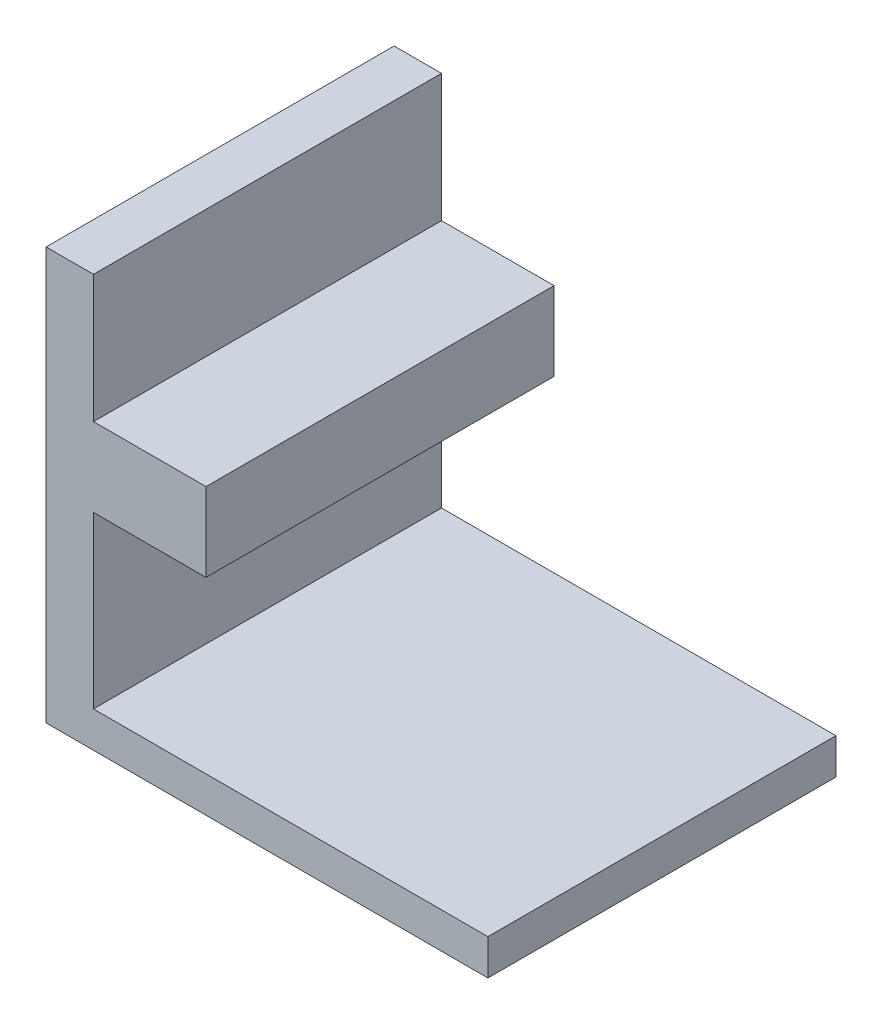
ISO-10303-21;
HEADER;
FILE_DESCRIPTION(('STEP AP214'),'2;1');
FILE_NAME('part.step','',(''),(''),'','','');
FILE_SCHEMA(('AUTOMOTIVE_DESIGN { 1 0 10303 214 1 1 1 1 }'));
ENDSEC;
DATA;
#1=APPLICATION_CONTEXT('core data for automotive mechanical design processes');
#2=APPLICATION_PROTOCOL_DEFINITION('international standard','automotive_design',2000,#1);
#3=PRODUCT_CONTEXT('',#1,'mechanical');
#4=PRODUCT('Part','Part','',(#3));
#5=PRODUCT_RELATED_PRODUCT_CATEGORY('part','',(#4));
#6=PRODUCT_DEFINITION_FORMATION('','',#4);
#7=PRODUCT_DEFINITION_CONTEXT('part definition',#1,'design');
#8=PRODUCT_DEFINITION('design','',#6,#7);
#9=PRODUCT_DEFINITION_SHAPE('','',#8);
#10=(LENGTH_UNIT() NAMED_UNIT(*) SI_UNIT(.MILLI.,.METRE.));
#11=(NAMED_UNIT(*) PLANE_ANGLE_UNIT() SI_UNIT($,.RADIAN.));
#12=(NAMED_UNIT(*) SI_UNIT($,.STERADIAN.) SOLID_ANGLE_UNIT());
#13=UNCERTAINTY_MEASURE_WITH_UNIT(LENGTH_MEASURE(1.E-05),#10,'distance_accuracy_value','');
#14=(GEOMETRIC_REPRESENTATION_CONTEXT(3) GLOBAL_UNCERTAINTY_ASSIGNED_CONTEXT((#13)) GLOBAL_UNIT_ASSIGNED_CONTEXT((#10,
#11,#12)) REPRESENTATION_CONTEXT('',''));
#15=CARTESIAN_POINT('',(0.,0.,0.));
#16=DIRECTION('',(0.,0.,1.));
#17=DIRECTION('',(1.,0.,0.));
#18=AXIS2_PLACEMENT_3D('',#15,#16,#17);
#19=CARTESIAN_POINT('',(18.1175022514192,13.684496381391,66.5));
#20=DIRECTION('',(-1.,0.,0.));
#21=DIRECTION('',(0.,0.,1.));
#22=AXIS2_PLACEMENT_3D('',#19,#20,#21);
#23=PLANE('',#22);
#24=DIRECTION('',(0.,0.,-1.));
#25=VECTOR('',#24,1.);
#26=CARTESIAN_POINT('',(18.1175022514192,78.7188677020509,66.5));
#27=LINE('',#26,#25);
#28=CARTESIAN_POINT('',(18.1175022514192,78.7188677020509,66.5));
#29=VERTEX_POINT('',#28);
#30=CARTESIAN_POINT('',(18.1175022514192,78.7188677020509,-66.5));
#31=VERTEX_POINT('',#30);
#32=EDGE_CURVE('E55',#29,#31,#27,.T.);
#33=ORIENTED_EDGE('',*,*,#32,.F.);
#34=DIRECTION('',(0.,1.,0.));
#35=VECTOR('',#34,1.);
#36=CARTESIAN_POINT('',(18.1175022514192,13.684496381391,66.5));
#37=LINE('',#36,#35);
#38=CARTESIAN_POINT('',(18.1175022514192,13.684496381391,66.5));
#39=VERTEX_POINT('',#38);
#40=EDGE_CURVE('E134',#39,#29,#37,.T.);
#41=ORIENTED_EDGE('',*,*,#40,.F.);
#42=DIRECTION('',(0.,0.,-1.));
#43=VECTOR('',#42,1.);
#44=CARTESIAN_POINT('',(18.1175022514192,13.684496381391,66.5));
#45=LINE('',#44,#43);
#46=CARTESIAN_POINT('',(18.1175022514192,13.684496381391,-66.5));
#47=VERTEX_POINT('',#46);
#48=EDGE_CURVE('E168',#39,#47,#45,.T.);
#49=ORIENTED_EDGE('',*,*,#48,.T.);
#50=DIRECTION('',(0.,1.,0.));
#51=VECTOR('',#50,1.);
#52=CARTESIAN_POINT('',(18.1175022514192,13.684496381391,-66.5));
#53=LINE('',#52,#51);
#54=EDGE_CURVE('E147',#47,#31,#53,.T.);
#55=ORIENTED_EDGE('',*,*,#54,.T.);
#56=EDGE_LOOP('',(#33,#41,#49,#55));
#57=FACE_BOUND('',#56,.T.);
#58=ADVANCED_FACE('F32',(#57),#23,.F.);
#59=DIRECTION('',(0.,0.,1.));
#60=VECTOR('',#59,1.);
#61=CARTESIAN_POINT('',(18.1175022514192,108.761947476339,66.5));
#62=LINE('',#61,#60);
#63=CARTESIAN_POINT('',(18.1175022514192,108.761947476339,-66.5));
#64=VERTEX_POINT('',#63);
#65=CARTESIAN_POINT('',(18.1175022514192,108.761947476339,66.5));
#66=VERTEX_POINT('',#65);
#67=EDGE_CURVE('E130',#64,#66,#62,.T.);
#68=ORIENTED_EDGE('',*,*,#67,.F.);
#69=CARTESIAN_POINT('',(18.1175022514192,157.514311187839,-66.5));
#70=VERTEX_POINT('',#69);
#71=EDGE_CURVE('E164',#64,#70,#53,.T.);
#72=ORIENTED_EDGE('',*,*,#71,.T.);
#73=DIRECTION('',(0.,0.,-1.));
#74=VECTOR('',#73,1.);
#75=CARTESIAN_POINT('',(18.1175022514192,157.514311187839,66.5));
#76=LINE('',#75,#74);
#77=CARTESIAN_POINT('',(18.1175022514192,157.514311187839,66.5));
#78=VERTEX_POINT('',#77);
#79=EDGE_CURVE('E155',#78,#70,#76,.T.);
#80=ORIENTED_EDGE('',*,*,#79,.F.);
#81=EDGE_CURVE('E47',#66,#78,#37,.T.);
#82=ORIENTED_EDGE('',*,*,#81,.F.);
#83=EDGE_LOOP('',(#68,#72,#80,#82));
#84=FACE_BOUND('',#83,.T.);
#85=ADVANCED_FACE('F204',(#84),#23,.F.);
#86=CARTESIAN_POINT('',(18.1175022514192,157.514311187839,66.5));
#87=DIRECTION('',(0.,-1.,0.));
#88=DIRECTION('',(0.,0.,-1.));
#89=AXIS2_PLACEMENT_3D('',#86,#87,#88);
#90=PLANE('',#89);
#91=DIRECTION('',(-1.,0.,0.));
#92=VECTOR('',#91,1.);
#93=CARTESIAN_POINT('',(18.1175022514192,157.514311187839,-66.5));
#94=LINE('',#93,#92);
#95=CARTESIAN_POINT('',(0.,157.514311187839,-66.5));
#96=VERTEX_POINT('',#95);
#97=EDGE_CURVE('E135',#70,#96,#94,.T.);
#98=ORIENTED_EDGE('',*,*,#97,.T.);
#99=DIRECTION('',(0.,0.,-1.));
#100=VECTOR('',#99,1.);
#101=CARTESIAN_POINT('',(0.,157.514311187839,66.5));
#102=LINE('',#101,#100);
#103=CARTESIAN_POINT('',(0.,157.514311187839,66.5));
#104=VERTEX_POINT('',#103);
#105=EDGE_CURVE('E11',#104,#96,#102,.T.);
#106=ORIENTED_EDGE('',*,*,#105,.F.);
#107=DIRECTION('',(-1.,0.,0.));
#108=VECTOR('',#107,1.);
#109=CARTESIAN_POINT('',(18.1175022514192,157.514311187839,66.5));
#110=LINE('',#109,#108);
#111=EDGE_CURVE('E144',#78,#104,#110,.T.);
#112=ORIENTED_EDGE('',*,*,#111,.F.);
#113=ORIENTED_EDGE('',*,*,#79,.T.);
#114=EDGE_LOOP('',(#98,#106,#112,#113));
#115=FACE_BOUND('',#114,.T.);
#116=ADVANCED_FACE('F34',(#115),#90,.F.);
#117=CARTESIAN_POINT('',(0.,157.514311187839,66.5));
#118=DIRECTION('',(1.,0.,0.));
#119=DIRECTION('',(0.,0.,-1.));
#120=AXIS2_PLACEMENT_3D('',#117,#118,#119);
#121=PLANE('',#120);
#122=DIRECTION('',(0.,-1.,0.));
#123=VECTOR('',#122,1.);
#124=CARTESIAN_POINT('',(0.,157.514311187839,-66.5));
#125=LINE('',#124,#123);
#126=CARTESIAN_POINT('',(0.,0.,-66.5));
#127=VERTEX_POINT('',#126);
#128=EDGE_CURVE('E138',#96,#127,#125,.T.);
#129=ORIENTED_EDGE('',*,*,#128,.T.);
#130=DIRECTION('',(0.,0.,-1.));
#131=VECTOR('',#130,1.);
#132=CARTESIAN_POINT('',(0.,0.,66.5));
#133=LINE('',#132,#131);
#134=CARTESIAN_POINT('',(0.,0.,66.5));
#135=VERTEX_POINT('',#134);
#136=EDGE_CURVE('E40',#135,#127,#133,.T.);
#137=ORIENTED_EDGE('',*,*,#136,.F.);
#138=DIRECTION('',(0.,-1.,0.));
#139=VECTOR('',#138,1.);
#140=CARTESIAN_POINT('',(0.,157.514311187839,66.5));
#141=LINE('',#140,#139);
#142=EDGE_CURVE('E146',#104,#135,#141,.T.);
#143=ORIENTED_EDGE('',*,*,#142,.F.);
#144=ORIENTED_EDGE('',*,*,#105,.T.);
#145=EDGE_LOOP('',(#129,#137,#143,#144));
#146=FACE_BOUND('',#145,.T.);
#147=ADVANCED_FACE('F200',(#146),#121,.F.);
#148=CARTESIAN_POINT('',(0.,0.,66.5));
#149=DIRECTION('',(0.,1.,0.));
#150=DIRECTION('',(0.,0.,1.));
#151=AXIS2_PLACEMENT_3D('',#148,#149,#150);
#152=PLANE('',#151);
#153=DIRECTION('',(1.,0.,0.));
#154=VECTOR('',#153,1.);
#155=CARTESIAN_POINT('',(0.,0.,-66.5));
#156=LINE('',#155,#154);
#157=CARTESIAN_POINT('',(168.839701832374,0.,-66.5));
#158=VERTEX_POINT('',#157);
#159=EDGE_CURVE('E158',#127,#158,#156,.T.);
#160=ORIENTED_EDGE('',*,*,#159,.T.);
#161=DIRECTION('',(0.,0.,-1.));
#162=VECTOR('',#161,1.);
#163=CARTESIAN_POINT('',(168.839701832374,0.,66.5));
#164=LINE('',#163,#162);
#165=CARTESIAN_POINT('',(168.839701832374,0.,66.5));
#166=VERTEX_POINT('',#165);
#167=EDGE_CURVE('E174',#166,#158,#164,.T.);
#168=ORIENTED_EDGE('',*,*,#167,.F.);
#169=DIRECTION('',(1.,0.,0.));
#170=VECTOR('',#169,1.);
#171=CARTESIAN_POINT('',(0.,0.,66.5));
#172=LINE('',#171,#170);
#173=EDGE_CURVE('E149',#135,#166,#172,.T.);
#174=ORIENTED_EDGE('',*,*,#173,.F.);
#175=ORIENTED_EDGE('',*,*,#136,.T.);
#176=EDGE_LOOP('',(#160,#168,#174,#175));
#177=FACE_BOUND('',#176,.T.);
#178=ADVANCED_FACE('F181',(#177),#152,.F.);
#179=CARTESIAN_POINT('',(168.839701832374,0.,66.5));
#180=DIRECTION('',(-1.,0.,0.));
#181=DIRECTION('',(0.,0.,1.));
#182=AXIS2_PLACEMENT_3D('',#179,#180,#181);
#183=PLANE('',#182);
#184=DIRECTION('',(0.,1.,0.));
#185=VECTOR('',#184,1.);
#186=CARTESIAN_POINT('',(168.839701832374,0.,-66.5));
#187=LINE('',#186,#185);
#188=CARTESIAN_POINT('',(168.839701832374,13.684496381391,-66.5));
#189=VERTEX_POINT('',#188);
#190=EDGE_CURVE('E160',#158,#189,#187,.T.);
#191=ORIENTED_EDGE('',*,*,#190,.T.);
#192=DIRECTION('',(0.,0.,-1.));
#193=VECTOR('',#192,1.);
#194=CARTESIAN_POINT('',(168.839701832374,13.684496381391,66.5));
#195=LINE('',#194,#193);
#196=CARTESIAN_POINT('',(168.839701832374,13.684496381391,66.5));
#197=VERTEX_POINT('',#196);
#198=EDGE_CURVE('E171',#197,#189,#195,.T.);
#199=ORIENTED_EDGE('',*,*,#198,.F.);
#200=DIRECTION('',(0.,1.,0.));
#201=VECTOR('',#200,1.);
#202=CARTESIAN_POINT('',(168.839701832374,0.,66.5));
#203=LINE('',#202,#201);
#204=EDGE_CURVE('E151',#166,#197,#203,.T.);
#205=ORIENTED_EDGE('',*,*,#204,.F.);
#206=ORIENTED_EDGE('',*,*,#167,.T.);
#207=EDGE_LOOP('',(#191,#199,#205,#206));
#208=FACE_BOUND('',#207,.T.);
#209=ADVANCED_FACE('F192',(#208),#183,.F.);
#210=CARTESIAN_POINT('',(168.839701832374,13.684496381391,66.5));
#211=DIRECTION('',(0.,-1.,0.));
#212=DIRECTION('',(0.,0.,-1.));
#213=AXIS2_PLACEMENT_3D('',#210,#211,#212);
#214=PLANE('',#213);
#215=DIRECTION('',(-1.,0.,0.));
#216=VECTOR('',#215,1.);
#217=CARTESIAN_POINT('',(168.839701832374,13.684496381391,-66.5));
#218=LINE('',#217,#216);
#219=EDGE_CURVE('E162',#189,#47,#218,.T.);
#220=ORIENTED_EDGE('',*,*,#219,.T.);
#221=ORIENTED_EDGE('',*,*,#48,.F.);
#222=DIRECTION('',(-1.,0.,0.));
#223=VECTOR('',#222,1.);
#224=CARTESIAN_POINT('',(168.839701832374,13.684496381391,66.5));
#225=LINE('',#224,#223);
#226=EDGE_CURVE('E153',#197,#39,#225,.T.);
#227=ORIENTED_EDGE('',*,*,#226,.F.);
#228=ORIENTED_EDGE('',*,*,#198,.T.);
#229=EDGE_LOOP('',(#220,#221,#227,#228));
#230=FACE_BOUND('',#229,.T.);
#231=ADVANCED_FACE('F196',(#230),#214,.F.);
#232=CARTESIAN_POINT('',(0.,157.514311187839,66.5));
#233=DIRECTION('',(0.,0.,1.));
#234=DIRECTION('',(1.,0.,0.));
#235=AXIS2_PLACEMENT_3D('',#232,#233,#234);
#236=PLANE('',#235);
#237=ORIENTED_EDGE('',*,*,#111,.T.);
#238=ORIENTED_EDGE('',*,*,#142,.T.);
#239=ORIENTED_EDGE('',*,*,#173,.T.);
#240=ORIENTED_EDGE('',*,*,#204,.T.);
#241=ORIENTED_EDGE('',*,*,#226,.T.);
#242=ORIENTED_EDGE('',*,*,#40,.T.);
#243=DIRECTION('',(-1.,0.,0.));
#244=VECTOR('',#243,1.);
#245=CARTESIAN_POINT('',(61.1175022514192,78.7188677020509,66.5));
#246=LINE('',#245,#244);
#247=CARTESIAN_POINT('',(61.1175022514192,78.7188677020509,66.5));
#248=VERTEX_POINT('',#247);
#249=EDGE_CURVE('E115',#248,#29,#246,.T.);
#250=ORIENTED_EDGE('',*,*,#249,.F.);
#251=DIRECTION('',(0.,-1.,0.));
#252=VECTOR('',#251,1.);
#253=CARTESIAN_POINT('',(61.1175022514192,108.761947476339,66.5));
#254=LINE('',#253,#252);
#255=CARTESIAN_POINT('',(61.1175022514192,108.761947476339,66.5));
#256=VERTEX_POINT('',#255);
#257=EDGE_CURVE('E121',#256,#248,#254,.T.);
#258=ORIENTED_EDGE('',*,*,#257,.F.);
#259=DIRECTION('',(-1.,0.,0.));
#260=VECTOR('',#259,1.);
#261=CARTESIAN_POINT('',(61.1175022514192,108.761947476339,66.5));
#262=LINE('',#261,#260);
#263=EDGE_CURVE('E208',#256,#66,#262,.T.);
#264=ORIENTED_EDGE('',*,*,#263,.T.);
#265=ORIENTED_EDGE('',*,*,#81,.T.);
#266=EDGE_LOOP('',(#237,#238,#239,#240,#241,#242,#250,#258,#264,#265));
#267=FACE_BOUND('',#266,.T.);
#268=ADVANCED_FACE('F133',(#267),#236,.T.);
#269=CARTESIAN_POINT('',(0.,157.514311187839,-66.5));
#270=DIRECTION('',(0.,0.,1.));
#271=DIRECTION('',(1.,0.,0.));
#272=AXIS2_PLACEMENT_3D('',#269,#270,#271);
#273=PLANE('',#272);
#274=ORIENTED_EDGE('',*,*,#97,.F.);
#275=ORIENTED_EDGE('',*,*,#71,.F.);
#276=DIRECTION('',(-1.,0.,0.));
#277=VECTOR('',#276,1.);
#278=CARTESIAN_POINT('',(61.1175022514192,108.761947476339,-66.5));
#279=LINE('',#278,#277);
#280=CARTESIAN_POINT('',(61.1175022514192,108.761947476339,-66.5));
#281=VERTEX_POINT('',#280);
#282=EDGE_CURVE('E140',#281,#64,#279,.T.);
#283=ORIENTED_EDGE('',*,*,#282,.F.);
#284=DIRECTION('',(0.,1.,0.));
#285=VECTOR('',#284,1.);
#286=CARTESIAN_POINT('',(61.1175022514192,108.761947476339,-66.5));
#287=LINE('',#286,#285);
#288=CARTESIAN_POINT('',(61.1175022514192,78.7188677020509,-66.5));
#289=VERTEX_POINT('',#288);
#290=EDGE_CURVE('E120',#289,#281,#287,.T.);
#291=ORIENTED_EDGE('',*,*,#290,.F.);
#292=DIRECTION('',(-1.,0.,0.));
#293=VECTOR('',#292,1.);
#294=CARTESIAN_POINT('',(61.1175022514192,78.7188677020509,-66.5));
#295=LINE('',#294,#293);
#296=EDGE_CURVE('E117',#289,#31,#295,.T.);
#297=ORIENTED_EDGE('',*,*,#296,.T.);
#298=ORIENTED_EDGE('',*,*,#54,.F.);
#299=ORIENTED_EDGE('',*,*,#219,.F.);
#300=ORIENTED_EDGE('',*,*,#190,.F.);
#301=ORIENTED_EDGE('',*,*,#159,.F.);
#302=ORIENTED_EDGE('',*,*,#128,.F.);
#303=EDGE_LOOP('',(#274,#275,#283,#291,#297,#298,#299,#300,#301,#302));
#304=FACE_BOUND('',#303,.T.);
#305=ADVANCED_FACE('F187',(#304),#273,.F.);
#306=CARTESIAN_POINT('',(61.1175022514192,78.7188677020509,66.5));
#307=DIRECTION('',(0.,1.,0.));
#308=DIRECTION('',(0.,0.,1.));
#309=AXIS2_PLACEMENT_3D('',#306,#307,#308);
#310=PLANE('',#309);
#311=ORIENTED_EDGE('',*,*,#32,.T.);
#312=ORIENTED_EDGE('',*,*,#296,.F.);
#313=DIRECTION('',(0.,0.,-1.));
#314=VECTOR('',#313,1.);
#315=CARTESIAN_POINT('',(61.1175022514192,78.7188677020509,66.5));
#316=LINE('',#315,#314);
#317=EDGE_CURVE('E111',#248,#289,#316,.T.);
#318=ORIENTED_EDGE('',*,*,#317,.F.);
#319=ORIENTED_EDGE('',*,*,#249,.T.);
#320=EDGE_LOOP('',(#311,#312,#318,#319));
#321=FACE_BOUND('',#320,.T.);
#322=ADVANCED_FACE('F113',(#321),#310,.F.);
#323=CARTESIAN_POINT('',(61.1175022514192,108.761947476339,66.5));
#324=DIRECTION('',(0.,-1.,0.));
#325=DIRECTION('',(0.,0.,-1.));
#326=AXIS2_PLACEMENT_3D('',#323,#324,#325);
#327=PLANE('',#326);
#328=ORIENTED_EDGE('',*,*,#67,.T.);
#329=ORIENTED_EDGE('',*,*,#263,.F.);
#330=DIRECTION('',(0.,0.,1.));
#331=VECTOR('',#330,1.);
#332=CARTESIAN_POINT('',(61.1175022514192,108.761947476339,66.5));
#333=LINE('',#332,#331);
#334=EDGE_CURVE('E126',#281,#256,#333,.T.);
#335=ORIENTED_EDGE('',*,*,#334,.F.);
#336=ORIENTED_EDGE('',*,*,#282,.T.);
#337=EDGE_LOOP('',(#328,#329,#335,#336));
#338=FACE_BOUND('',#337,.T.);
#339=ADVANCED_FACE('F207',(#338),#327,.F.);
#340=CARTESIAN_POINT('',(61.1175022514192,78.7188677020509,66.5));
#341=DIRECTION('',(1.,0.,0.));
#342=DIRECTION('',(0.,0.,-1.));
#343=AXIS2_PLACEMENT_3D('',#340,#341,#342);
#344=PLANE('',#343);
#345=ORIENTED_EDGE('',*,*,#257,.T.);
#346=ORIENTED_EDGE('',*,*,#317,.T.);
#347=ORIENTED_EDGE('',*,*,#290,.T.);
#348=ORIENTED_EDGE('',*,*,#334,.T.);
#349=EDGE_LOOP('',(#345,#346,#347,#348));
#350=FACE_BOUND('',#349,.T.);
#351=ADVANCED_FACE('F124',(#350),#344,.T.);
#352=CLOSED_SHELL('',(#58,#85,#116,#147,#178,#209,#231,#268,#305,#322,#339,#351));
#353=MANIFOLD_SOLID_BREP('B2',#352);
#354=ADVANCED_BREP_SHAPE_REPRESENTATION('',(#18,#353),#14);
#355=SHAPE_DEFINITION_REPRESENTATION(#9,#354);
ENDSEC;
END-ISO-10303-21;
